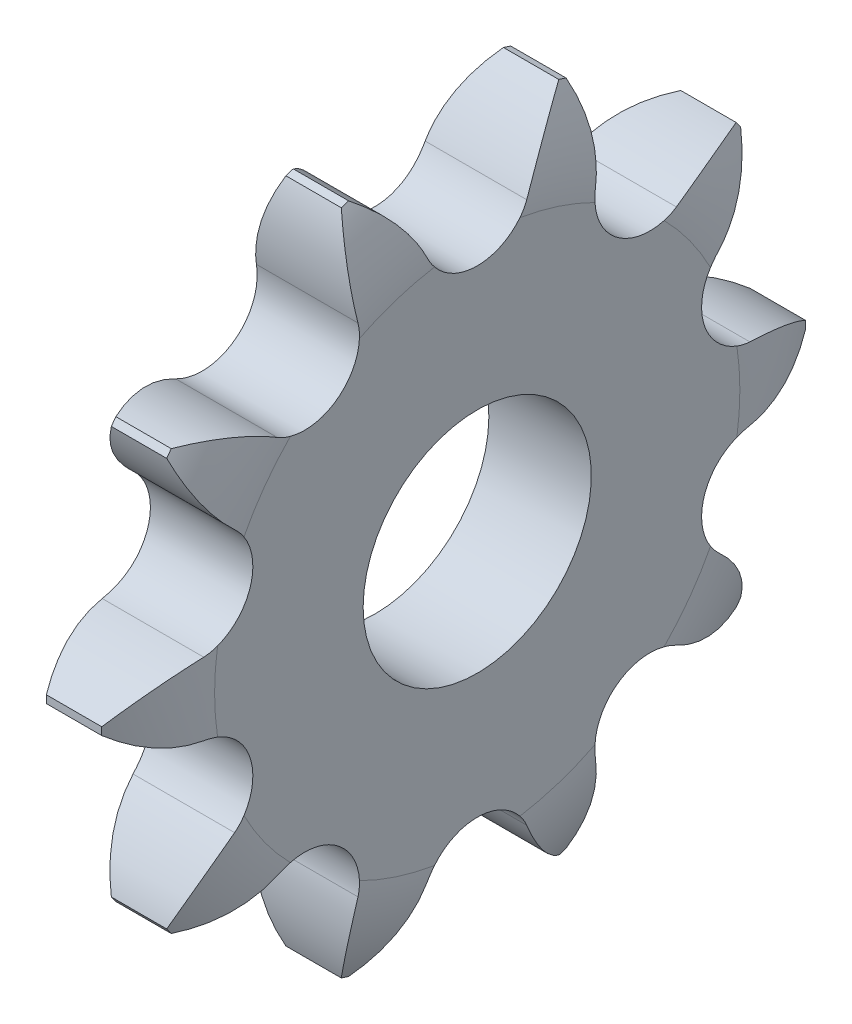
from build123d import *

# Parameters (mm, degrees)
TOOTHCUT_DEPTH  = 90.07413652
TEETHCUTS_COUNT = 10
TEETHCUTS_ANGLE = 324
BORSKE_R        = 20
BORE_DEPTH      = 50.0005


with BuildPart() as part:
    # BasProSke → Base-Revolve (revolve)
    with BuildSketch(Plane(origin=(0, 0, 0), x_dir=(1, 0, 0), z_dir=(0, 1, 0)), mode=Mode.PRIVATE) as base_revolve_sk:
        with BuildLine():
            Line((0, 0), (0, 46.036937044))
            ThreePointArc((0, 46.036937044), (1.049211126, 54.131630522), (4.1275, 61.6913292))
            Line((4.1275, 61.6913292), (13.8325, 61.6913292))
            ThreePointArc((13.8325, 61.6913292), (16.910788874, 54.131630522), (17.96, 46.036937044))
            Line((17.96, 46.036937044), (17.96, 0))
            Line((17.96, 0), (0, 0))
        make_face()
    revolve(base_revolve_sk.sketch.rotate(Axis((-10, 0, 0), (1, 0, 0)), 180), axis=Axis((-10, 0, 0), (1, 0, 0)))

    # TooCutSke → ToothCut (cut, through all)
    with BuildSketch(Plane(origin=(0, 0, 0), x_dir=(0, 0, -1), z_dir=(1, 0, 0))):
        with BuildLine():
            ThreePointArc((8.754054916, 47.478376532), (13.007596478, 54.093397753), (18.963224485, 59.229701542))
            ThreePointArc((18.963224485, 59.229701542), (0, 62.1913292), (-18.963224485, 59.229701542))
            ThreePointArc((-18.963224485, 59.229701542), (-13.007596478, 54.093397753), (-8.754054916, 47.478376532))
            ThreePointArc((-8.754054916, 47.478376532), (0, 41.8475792), (8.754054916, 47.478376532))
        make_face()
    toothcut = extrude(amount=TOOTHCUT_DEPTH, mode=Mode.SUBTRACT)

    # TeethCuts: ToothCut ×10 about axis
    teethcuts_axis = Axis((-10, 0, 0), (1, 0, 0))
    for i in range(1, TEETHCUTS_COUNT):
        add(toothcut.rotate(teethcuts_axis, i * TEETHCUTS_ANGLE / (TEETHCUTS_COUNT - 1)), mode=Mode.SUBTRACT)

    # BorSke → Bore (cut, symmetric)
    with BuildSketch(Plane(origin=(0, 0, 0), x_dir=(0, 0, -1), z_dir=(1, 0, 0))):
        with Locations(Location((0, 0, 0), (0, 0, 180))):
            Circle(BORSKE_R)
    extrude(amount=BORE_DEPTH, both=True, mode=Mode.SUBTRACT)


solid = part.part
